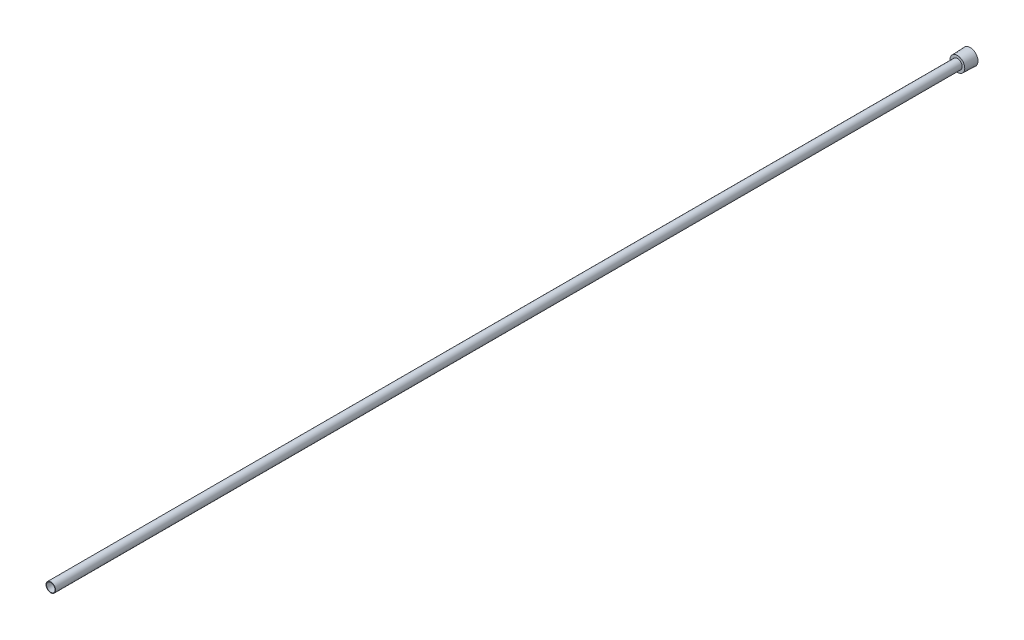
from build123d import *

# Parameters (mm, degrees)
SKETCH2_R          = 2.1209
CUT_EXTRUDE1_DEPTH = 458.233247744
CUT_EXTRUDE2_DEPTH = 3.96875


with BuildPart() as part:
    # Sketch1 → Revolve1 (revolve)
    with BuildSketch(Plane(origin=(0, 0, 0), x_dir=(0, 0, -1), z_dir=(1, 0, 0)), mode=Mode.PRIVATE) as revolve1_sk:
        Polygon((-457.2, 0), (0, 0), (0, 3.8989), (-6.35, 3.667387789), (-6.35, 2.3749), (-457.2, 2.3749), align=None)
    revolve(revolve1_sk.sketch.rotate(Axis((0, 0, 0), (0, 0, -1)), 90), axis=Axis((0, 0, 0), (0, 0, -1)))

    # Sketch2 → Cut-Extrude1 (cut, through all)
    with BuildSketch(Plane.XY.offset(457.2)):
        Circle(SKETCH2_R)
    extrude(amount=-CUT_EXTRUDE1_DEPTH, mode=Mode.SUBTRACT)

    # Sketch3 → Cut-Extrude2 (cut)
    with BuildSketch(Plane(origin=(0, 0, 0), x_dir=(-1, 0, 0), z_dir=(0, 0, -1))):
        Polygon((0, -2.749630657), (2.38125, -1.374815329), (2.38125, 1.374815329), (0, 2.749630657), (-2.38125, 1.374815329), (-2.38125, -1.374815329), align=None)
    extrude(amount=-CUT_EXTRUDE2_DEPTH, mode=Mode.SUBTRACT)


solid = part.part
